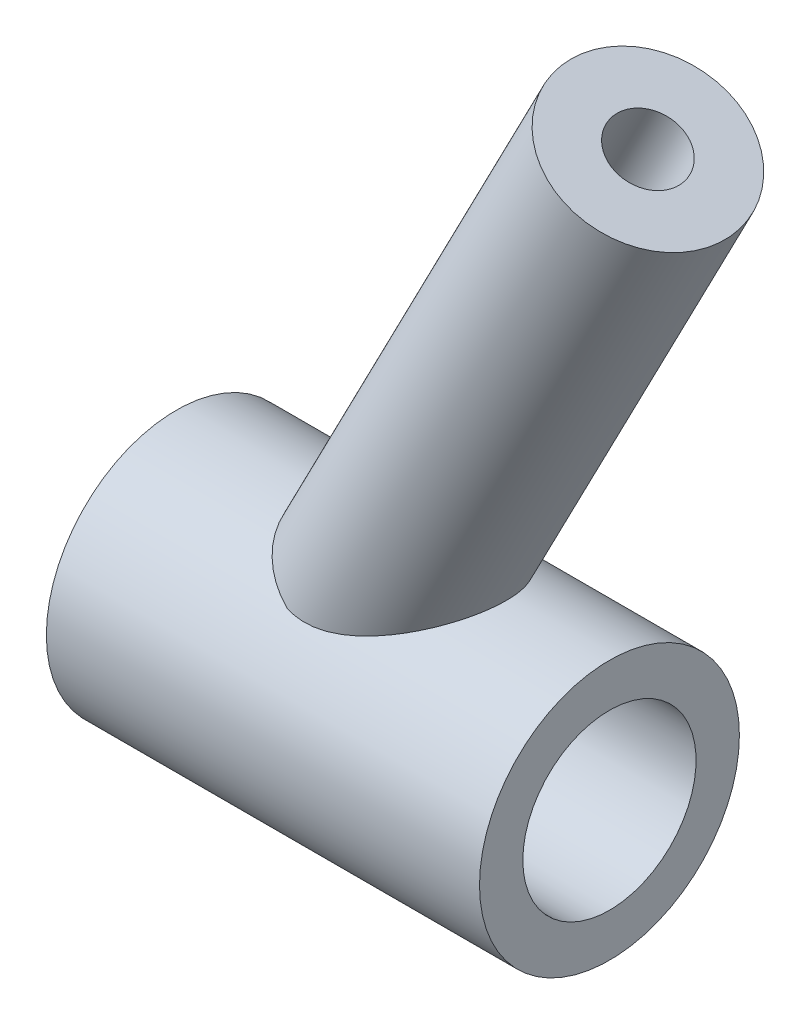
from build123d import *

# Parameters (mm, degrees)
ESQUISSE1_W      = 5
ESQUISSE1_H      = 0.5
ESQUISSE3_R      = 0.4
EXTRUSION1_DEPTH = 6.5


with BuildPart() as part:
    # Esquisse1 → R_volution1 (revolve)
    with BuildSketch(Plane.XY, mode=Mode.PRIVATE) as r_volution1_sk:
        with Locations((2.5, 1.25)):
            Rectangle(ESQUISSE1_W, ESQUISSE1_H)
    revolve(r_volution1_sk.sketch.rotate(Axis((0, 0, 0), (1, 0, 0)), 90), axis=Axis((0, 0, 0), (1, 0, 0)))

    # Esquisse2 → R_volution2 (revolve)
    with BuildSketch(Plane.XY):
        Polygon((1.555103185, 1.5), (4.556095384, 7.289311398), (5.443904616, 6.829099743), (2.442912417, 1.039788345), align=None)
    revolve(axis=Axis((5.443904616, 6.829099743, 0), (-0.46021165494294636, -0.8878092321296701, 0)))

    # Esquisse3 → Extrusion1 (cut)
    with BuildSketch(Plane(origin=(3.94322515, 7.607003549, 0), x_dir=(0.8878092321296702, -0.46021165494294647, 0), z_dir=(0.46021165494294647, 0.8878092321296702, 0))):
        with Locations(Location((1.690317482, 0, 0), (0, 0, 180))):
            Circle(ESQUISSE3_R)
    extrude(amount=-EXTRUSION1_DEPTH, mode=Mode.SUBTRACT)


solid = part.part
